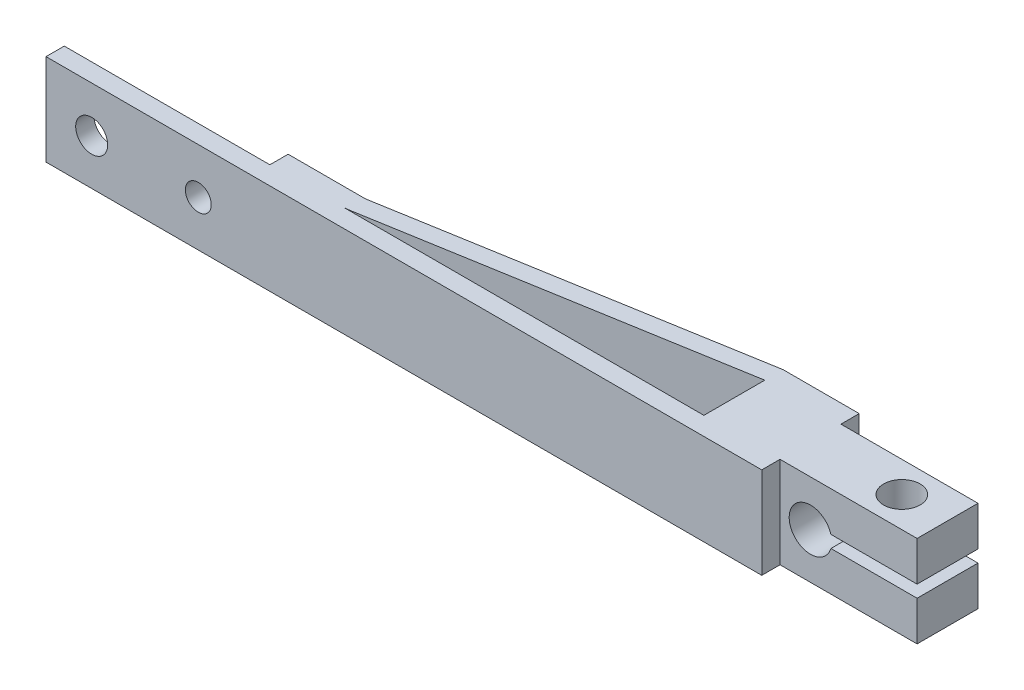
from build123d import *

# Parameters (mm, degrees)
ACCORCHE_DEPTH                    = 20
ESQUISSE2_R                       = 6
PER_AGE_POUR_VIS_DE_SERRAGE_DEPTH = 79.74007874
ESQUISSE3_W                       = 235
ESQUISSE3_H                       = 30
ESQUISSE3_R                       = 5.25
ESQUISSE3_R_2                     = 4.25
LEVIER_DEPTH                      = 6
RENFORT_DEPTH                     = 30


with BuildPart() as part:
    # Esquisse1 → Accorche (new body)
    with BuildSketch(Plane.XY):
        with BuildLine():
            Line((70, 17), (70, 30))
            Line((70, 30), (0, 30))
            Line((0, 30), (0, 0))
            Line((0, 0), (70, 0))
            Line((70, 0), (70, 13))
            Line((70, 13), (41.708203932, 13))
            ThreePointArc((41.708203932, 13), (28, 15), (41.708203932, 17))
            Line((41.708203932, 17), (70, 17))
        make_face()
    extrude(amount=ACCORCHE_DEPTH)

    # Esquisse2 → Per_age pour vis de serrage (cut, through all)
    with BuildSketch(Plane(origin=(0, 30, 0), x_dir=(-1, 0, 0), z_dir=(0, 1, 0))):
        with Locations((-55, 10)):
            Circle(ESQUISSE2_R)
    extrude(amount=-PER_AGE_POUR_VIS_DE_SERRAGE_DEPTH, mode=Mode.SUBTRACT)

    # Esquisse3 → levier (add)
    with BuildSketch(Plane.XY.offset(20)):
        with Locations((-92.5, 15)):
            Rectangle(ESQUISSE3_W, ESQUISSE3_H)
        with Locations((-195, 15)):
            Circle(ESQUISSE3_R, mode=Mode.SUBTRACT)
        with Locations((-160, 15)):
            Circle(ESQUISSE3_R_2, mode=Mode.SUBTRACT)
    extrude(amount=LEVIER_DEPTH)

    # Esquisse4 → renfort (add)
    with BuildSketch(Plane(origin=(0, 30, 0), x_dir=(-1, 0, 0), z_dir=(0, 1, 0))):
        with BuildLine():
            Line((0, 0), (116.16718996, 19.773138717))
            ThreePointArc((116.16718996, 19.773138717), (117.504800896, 19.943183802), (118.851979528, 20))
            Line((118.851979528, 20), (142.5, 20))
            Line((142.5, 20), (142.5, 14))
            Line((142.5, 14), (117.924764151, 14))
            ThreePointArc((117.924764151, 14), (117.079798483, 13.964237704), (116.240876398, 13.857206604))
            Line((116.240876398, 13.857206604), (0, -6))
            Line((0, -6), (-25, -6))
            Line((-25, -6), (-25, 0))
            Line((-25, 0), (0, 0))
        make_face()
    extrude(amount=-RENFORT_DEPTH)


solid = part.part
